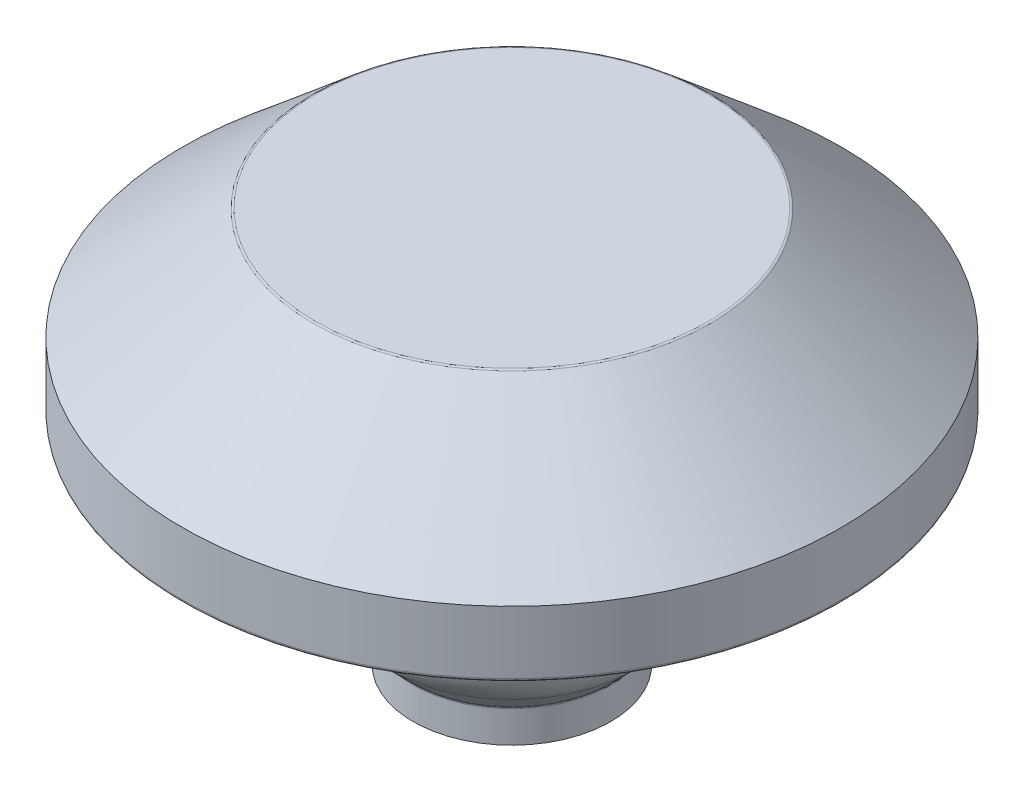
from build123d import *

# Parameters (mm, degrees)
FILLET1_R = 0.05


with BuildPart() as part:
    # Sketch1 → Revolve1 (revolve)
    with BuildSketch(Plane.XY, mode=Mode.PRIVATE) as revolve1_sk:
        with BuildLine():
            Line((0, 6), (3, 6))
            Line((3, 6), (5, 4.3))
            Line((5, 4.3), (5, 3.3))
            Line((5, 3.3), (4.5, 3.3))
            Line((4.5, 3.3), (2, 4.8))
            Line((2, 4.8), (1.85, 2))
            ThreePointArc((1.85, 2), (2.088172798, 1.425), (1.85, 0.85))
            Line((1.85, 0.85), (1.5, 0.5))
            Line((1.5, 0.5), (1.5, 0))
            Line((1.5, 0), (0, 0))
            Line((0, 0), (0, 6))
        make_face()
    revolve(revolve1_sk.sketch.rotate(Axis((0, 0, 0), (0, 1, 0)), 90), axis=Axis((0, 0, 0), (0, 1, 0)))

    # Fillet1
    fillet1_edges = [part.edges().sort_by_distance(p)[0] for p in [
        (0, 2, 1.85),
        (0, 4.8, 2),
        (0, 3.3, 4.5),
        (0, 3.3, 5),
        (0, 6, 3),
        (0, 0.5, 1.5),
    ]]
    fillet(fillet1_edges, radius=FILLET1_R)


solid = part.part
